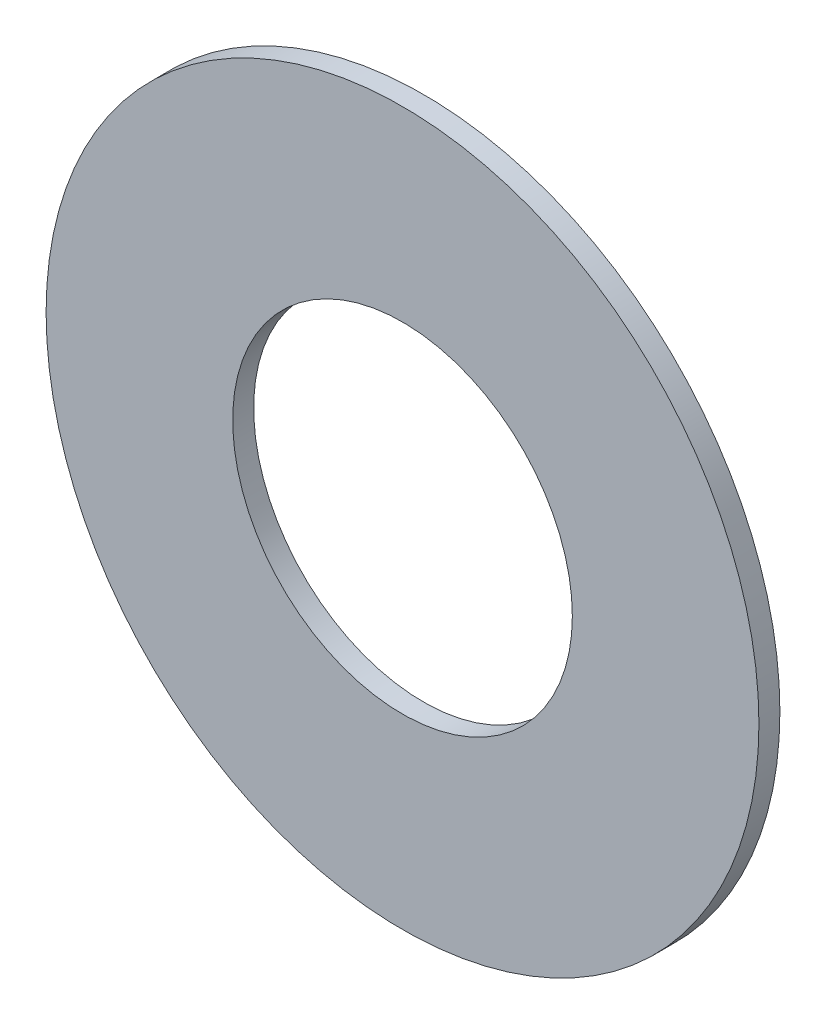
ISO-10303-21;
HEADER;
FILE_DESCRIPTION(('STEP AP214'),'2;1');
FILE_NAME('part.step','',(''),(''),'','','');
FILE_SCHEMA(('AUTOMOTIVE_DESIGN { 1 0 10303 214 1 1 1 1 }'));
ENDSEC;
DATA;
#1=APPLICATION_CONTEXT('core data for automotive mechanical design processes');
#2=APPLICATION_PROTOCOL_DEFINITION('international standard','automotive_design',2000,#1);
#3=PRODUCT_CONTEXT('',#1,'mechanical');
#4=PRODUCT('Part','Part','',(#3));
#5=PRODUCT_RELATED_PRODUCT_CATEGORY('part','',(#4));
#6=PRODUCT_DEFINITION_FORMATION('','',#4);
#7=PRODUCT_DEFINITION_CONTEXT('part definition',#1,'design');
#8=PRODUCT_DEFINITION('design','',#6,#7);
#9=PRODUCT_DEFINITION_SHAPE('','',#8);
#10=(LENGTH_UNIT() NAMED_UNIT(*) SI_UNIT(.MILLI.,.METRE.));
#11=(NAMED_UNIT(*) PLANE_ANGLE_UNIT() SI_UNIT($,.RADIAN.));
#12=(NAMED_UNIT(*) SI_UNIT($,.STERADIAN.) SOLID_ANGLE_UNIT());
#13=UNCERTAINTY_MEASURE_WITH_UNIT(LENGTH_MEASURE(1.E-05),#10,'distance_accuracy_value','');
#14=(GEOMETRIC_REPRESENTATION_CONTEXT(3) GLOBAL_UNCERTAINTY_ASSIGNED_CONTEXT((#13)) GLOBAL_UNIT_ASSIGNED_CONTEXT((#10,
#11,#12)) REPRESENTATION_CONTEXT('',''));
#15=CARTESIAN_POINT('',(0.,0.,0.));
#16=DIRECTION('',(0.,0.,1.));
#17=DIRECTION('',(1.,0.,0.));
#18=AXIS2_PLACEMENT_3D('',#15,#16,#17);
#19=CARTESIAN_POINT('',(0.,0.,1.));
#20=DIRECTION('',(0.,0.,1.));
#21=DIRECTION('',(1.,0.,0.));
#22=AXIS2_PLACEMENT_3D('',#19,#20,#21);
#23=PLANE('',#22);
#24=CARTESIAN_POINT('',(0.,0.,1.));
#25=DIRECTION('',(0.,0.,1.));
#26=DIRECTION('',(1.,0.,0.));
#27=AXIS2_PLACEMENT_3D('',#24,#25,#26);
#28=CIRCLE('',#27,17.);
#29=CARTESIAN_POINT('',(17.,0.,1.));
#30=VERTEX_POINT('',#29);
#31=EDGE_CURVE('E10',#30,#30,#28,.T.);
#32=ORIENTED_EDGE('',*,*,#31,.T.);
#33=EDGE_LOOP('',(#32));
#34=FACE_BOUND('',#33,.T.);
#35=CARTESIAN_POINT('',(0.,0.,1.));
#36=DIRECTION('',(0.,0.,1.));
#37=DIRECTION('',(1.,0.,0.));
#38=AXIS2_PLACEMENT_3D('',#35,#36,#37);
#39=CIRCLE('',#38,8.1);
#40=CARTESIAN_POINT('',(8.1,0.,1.));
#41=VERTEX_POINT('',#40);
#42=EDGE_CURVE('E39',#41,#41,#39,.T.);
#43=ORIENTED_EDGE('',*,*,#42,.F.);
#44=EDGE_LOOP('',(#43));
#45=FACE_BOUND('',#44,.T.);
#46=ADVANCED_FACE('F28',(#34,#45),#23,.T.);
#47=CARTESIAN_POINT('',(0.,0.,0.));
#48=DIRECTION('',(0.,0.,1.));
#49=DIRECTION('',(1.,0.,0.));
#50=AXIS2_PLACEMENT_3D('',#47,#48,#49);
#51=PLANE('',#50);
#52=CARTESIAN_POINT('',(0.,0.,0.));
#53=DIRECTION('',(0.,0.,1.));
#54=DIRECTION('',(1.,0.,0.));
#55=AXIS2_PLACEMENT_3D('',#52,#53,#54);
#56=CIRCLE('',#55,17.);
#57=CARTESIAN_POINT('',(17.,0.,0.));
#58=VERTEX_POINT('',#57);
#59=EDGE_CURVE('E35',#58,#58,#56,.T.);
#60=ORIENTED_EDGE('',*,*,#59,.F.);
#61=EDGE_LOOP('',(#60));
#62=FACE_BOUND('',#61,.T.);
#63=CARTESIAN_POINT('',(0.,0.,0.));
#64=DIRECTION('',(0.,0.,1.));
#65=DIRECTION('',(1.,0.,0.));
#66=AXIS2_PLACEMENT_3D('',#63,#64,#65);
#67=CIRCLE('',#66,8.1);
#68=CARTESIAN_POINT('',(8.1,0.,0.));
#69=VERTEX_POINT('',#68);
#70=EDGE_CURVE('E43',#69,#69,#67,.T.);
#71=ORIENTED_EDGE('',*,*,#70,.T.);
#72=EDGE_LOOP('',(#71));
#73=FACE_BOUND('',#72,.T.);
#74=ADVANCED_FACE('F49',(#62,#73),#51,.F.);
#75=CARTESIAN_POINT('',(0.,0.,1.));
#76=DIRECTION('',(0.,0.,-1.));
#77=DIRECTION('',(-1.,0.,0.));
#78=AXIS2_PLACEMENT_3D('',#75,#76,#77);
#79=CYLINDRICAL_SURFACE('',#78,17.);
#80=ORIENTED_EDGE('',*,*,#31,.F.);
#81=EDGE_LOOP('',(#80));
#82=FACE_BOUND('',#81,.T.);
#83=ORIENTED_EDGE('',*,*,#59,.T.);
#84=EDGE_LOOP('',(#83));
#85=FACE_BOUND('',#84,.T.);
#86=ADVANCED_FACE('F30',(#82,#85),#79,.T.);
#87=CARTESIAN_POINT('',(0.,0.,1.));
#88=DIRECTION('',(0.,0.,-1.));
#89=DIRECTION('',(-1.,0.,0.));
#90=AXIS2_PLACEMENT_3D('',#87,#88,#89);
#91=CYLINDRICAL_SURFACE('',#90,8.1);
#92=ORIENTED_EDGE('',*,*,#42,.T.);
#93=EDGE_LOOP('',(#92));
#94=FACE_BOUND('',#93,.T.);
#95=ORIENTED_EDGE('',*,*,#70,.F.);
#96=EDGE_LOOP('',(#95));
#97=FACE_BOUND('',#96,.T.);
#98=ADVANCED_FACE('F51',(#94,#97),#91,.F.);
#99=CLOSED_SHELL('',(#46,#74,#86,#98));
#100=MANIFOLD_SOLID_BREP('B2',#99);
#101=ADVANCED_BREP_SHAPE_REPRESENTATION('',(#18,#100),#14);
#102=SHAPE_DEFINITION_REPRESENTATION(#9,#101);
ENDSEC;
END-ISO-10303-21;
